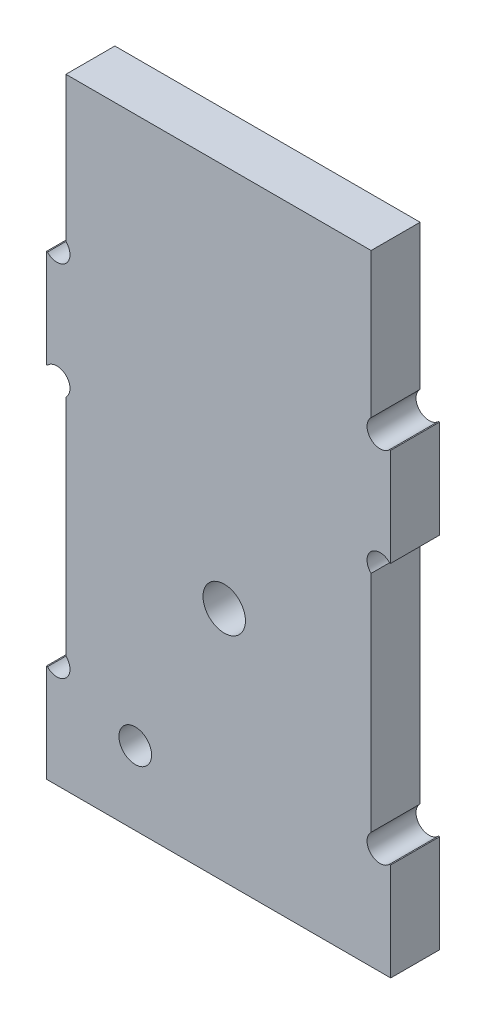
from build123d import *

# Parameters (mm, degrees)
BOSS_EXTRU_1_DEPTH      = 6
ESQUISSE2_W             = 37.4
ESQUISSE2_H             = 21.375319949
BOSS_EXTRU_2_DEPTH      = 6
ESQUISSE3_R             = 1.6
ENL_V_MAT_EXTRU_1_DEPTH = 54.433042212
ESQUISSE4_R             = 2
ESQUISSE4_R_2           = 2.6
ENL_V_MAT_EXTRU_2_DEPTH = 54.433042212
ESQUISSE5_W             = 14.065516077
ESQUISSE5_H             = 78.325618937
ENL_V_MAT_EXTRU_3_DEPTH = 10


with BuildPart() as part:
    # Esquisse1 → Boss.-Extru.1 (new body)
    with BuildSketch(Plane.XY):
        with BuildLine():
            Line((-24.7, 27), (24.7, 27))
            Line((24.7, 27), (24.7, 15))
            Line((24.7, 15), (20.961895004, 15))
            ThreePointArc((20.961895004, 15), (18.66862915, 15.03137085), (18.7, 12.738104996))
            Line((18.7, 12.738104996), (18.7, -14.738104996))
            ThreePointArc((18.7, -14.738104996), (18.66862915, -17.03137085), (20.961895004, -17))
            Line((20.961895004, -17), (24.7, -17))
            Line((24.7, -17), (24.7, -29))
            Line((24.7, -29), (-24.7, -29))
            Line((-24.7, -29), (-24.7, -17))
            Line((-24.7, -17), (-20.961895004, -17))
            ThreePointArc((-20.961895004, -17), (-18.66862915, -17.03137085), (-18.7, -14.738104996))
            Line((-18.7, -14.738104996), (-18.7, 12.738104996))
            ThreePointArc((-18.7, 12.738104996), (-18.66862915, 15.03137085), (-20.961895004, 15))
            Line((-20.961895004, 15), (-24.7, 15))
            Line((-24.7, 15), (-24.7, 27))
        make_face()
    extrude(amount=BOSS_EXTRU_1_DEPTH)

    # Esquisse2 → Boss.-Extru.2 (add)
    with BuildSketch(Plane.XY.offset(6)):
        with Locations((0, 36.312340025)):
            Rectangle(ESQUISSE2_W, ESQUISSE2_H)
    extrude(amount=-BOSS_EXTRU_2_DEPTH)

    # Esquisse3 → Enl_v. mat.-Extru.1 (cut, through all)
    with BuildSketch(Plane.XY.offset(6)):
        with Locations((-19.8, 28.1)):
            Circle(ESQUISSE3_R)
        with Locations((19.8, 28.1)):
            Circle(ESQUISSE3_R)
    extrude(amount=-ENL_V_MAT_EXTRU_1_DEPTH, mode=Mode.SUBTRACT)

    # Esquisse4 → Enl_v. mat.-Extru.2 (cut, through all)
    with BuildSketch(Plane.XY.offset(6)):
        with Locations((-10.2, -20)):
            Circle(ESQUISSE4_R)
        with Locations((0.7, 0)):
            Circle(ESQUISSE4_R_2)
    extrude(amount=-ENL_V_MAT_EXTRU_2_DEPTH, mode=Mode.SUBTRACT)

    # Esquisse5 → Enl_v. mat.-Extru.3 (cut)
    with BuildSketch(Plane.XY.offset(6)):
        with Locations((28.132758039, 1.741620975)):
            Rectangle(ESQUISSE5_W, ESQUISSE5_H)
        with Locations((-28.132758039, 1.741620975)):
            Rectangle(ESQUISSE5_W, ESQUISSE5_H)
    extrude(amount=-ENL_V_MAT_EXTRU_3_DEPTH, mode=Mode.SUBTRACT)


solid = part.part
